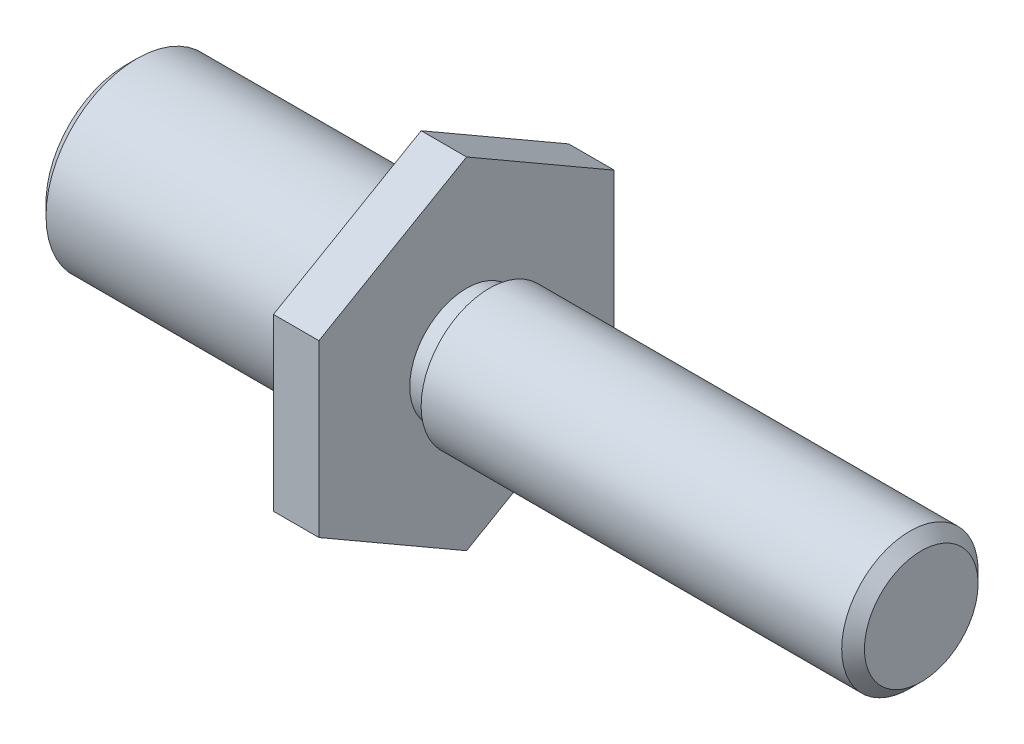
ISO-10303-21;
HEADER;
FILE_DESCRIPTION(('STEP AP214'),'2;1');
FILE_NAME('part.step','',(''),(''),'','','');
FILE_SCHEMA(('AUTOMOTIVE_DESIGN { 1 0 10303 214 1 1 1 1 }'));
ENDSEC;
DATA;
#1=APPLICATION_CONTEXT('core data for automotive mechanical design processes');
#2=APPLICATION_PROTOCOL_DEFINITION('international standard','automotive_design',2000,#1);
#3=PRODUCT_CONTEXT('',#1,'mechanical');
#4=PRODUCT('Part','Part','',(#3));
#5=PRODUCT_RELATED_PRODUCT_CATEGORY('part','',(#4));
#6=PRODUCT_DEFINITION_FORMATION('','',#4);
#7=PRODUCT_DEFINITION_CONTEXT('part definition',#1,'design');
#8=PRODUCT_DEFINITION('design','',#6,#7);
#9=PRODUCT_DEFINITION_SHAPE('','',#8);
#10=(LENGTH_UNIT() NAMED_UNIT(*) SI_UNIT(.MILLI.,.METRE.));
#11=(NAMED_UNIT(*) PLANE_ANGLE_UNIT() SI_UNIT($,.RADIAN.));
#12=(NAMED_UNIT(*) SI_UNIT($,.STERADIAN.) SOLID_ANGLE_UNIT());
#13=UNCERTAINTY_MEASURE_WITH_UNIT(LENGTH_MEASURE(1.E-05),#10,'distance_accuracy_value','');
#14=(GEOMETRIC_REPRESENTATION_CONTEXT(3) GLOBAL_UNCERTAINTY_ASSIGNED_CONTEXT((#13)) GLOBAL_UNIT_ASSIGNED_CONTEXT((#10,
#11,#12)) REPRESENTATION_CONTEXT('',''));
#15=CARTESIAN_POINT('',(0.,0.,0.));
#16=DIRECTION('',(0.,0.,1.));
#17=DIRECTION('',(1.,0.,0.));
#18=AXIS2_PLACEMENT_3D('',#15,#16,#17);
#19=CARTESIAN_POINT('',(0.,0.,0.));
#20=DIRECTION('',(1.,0.,0.));
#21=DIRECTION('',(0.,0.,-1.));
#22=AXIS2_PLACEMENT_3D('',#19,#20,#21);
#23=PLANE('',#22);
#24=CARTESIAN_POINT('',(0.,0.,0.));
#25=DIRECTION('',(1.,0.,0.));
#26=DIRECTION('',(0.,0.,-1.));
#27=AXIS2_PLACEMENT_3D('',#24,#25,#26);
#28=CIRCLE('',#27,3.5);
#29=CARTESIAN_POINT('',(0.,0.,-3.5));
#30=VERTEX_POINT('',#29);
#31=EDGE_CURVE('E158',#30,#30,#28,.F.);
#32=ORIENTED_EDGE('',*,*,#31,.T.);
#33=EDGE_LOOP('',(#32));
#34=FACE_BOUND('',#33,.T.);
#35=ADVANCED_FACE('F34',(#34),#23,.F.);
#36=CARTESIAN_POINT('',(0.,0.,0.));
#37=DIRECTION('',(-1.,0.,0.));
#38=DIRECTION('',(0.,0.,1.));
#39=AXIS2_PLACEMENT_3D('',#36,#37,#38);
#40=CYLINDRICAL_SURFACE('',#39,4.);
#41=CARTESIAN_POINT('',(0.5,0.,0.));
#42=DIRECTION('',(1.,0.,0.));
#43=DIRECTION('',(0.,0.,-1.));
#44=AXIS2_PLACEMENT_3D('',#41,#42,#43);
#45=CIRCLE('',#44,4.);
#46=CARTESIAN_POINT('',(0.5,0.,-4.));
#47=VERTEX_POINT('',#46);
#48=EDGE_CURVE('E161',#47,#47,#45,.T.);
#49=ORIENTED_EDGE('',*,*,#48,.T.);
#50=EDGE_LOOP('',(#49));
#51=FACE_BOUND('',#50,.T.);
#52=CARTESIAN_POINT('',(12.,0.,0.));
#53=DIRECTION('',(-1.,0.,0.));
#54=DIRECTION('',(0.,0.,1.));
#55=AXIS2_PLACEMENT_3D('',#52,#53,#54);
#56=CIRCLE('',#55,4.);
#57=CARTESIAN_POINT('',(12.,0.,4.));
#58=VERTEX_POINT('',#57);
#59=EDGE_CURVE('E155',#58,#58,#56,.T.);
#60=ORIENTED_EDGE('',*,*,#59,.T.);
#61=EDGE_LOOP('',(#60));
#62=FACE_BOUND('',#61,.T.);
#63=ADVANCED_FACE('F195',(#51,#62),#40,.T.);
#64=CARTESIAN_POINT('',(12.,4.,0.));
#65=DIRECTION('',(-1.,0.,0.));
#66=DIRECTION('',(0.,0.,1.));
#67=AXIS2_PLACEMENT_3D('',#64,#65,#66);
#68=PLANE('',#67);
#69=ORIENTED_EDGE('',*,*,#59,.F.);
#70=EDGE_LOOP('',(#69));
#71=FACE_BOUND('',#70,.T.);
#72=CARTESIAN_POINT('',(12.,0.,0.));
#73=DIRECTION('',(-1.,0.,0.));
#74=DIRECTION('',(0.,0.,1.));
#75=AXIS2_PLACEMENT_3D('',#72,#73,#74);
#76=CIRCLE('',#75,3.5);
#77=CARTESIAN_POINT('',(12.,0.,3.5));
#78=VERTEX_POINT('',#77);
#79=EDGE_CURVE('E152',#78,#78,#76,.T.);
#80=ORIENTED_EDGE('',*,*,#79,.T.);
#81=EDGE_LOOP('',(#80));
#82=FACE_BOUND('',#81,.T.);
#83=ADVANCED_FACE('F200',(#71,#82),#68,.F.);
#84=CARTESIAN_POINT('',(0.,0.,0.));
#85=DIRECTION('',(-1.,0.,0.));
#86=DIRECTION('',(0.,0.,1.));
#87=AXIS2_PLACEMENT_3D('',#84,#85,#86);
#88=CYLINDRICAL_SURFACE('',#87,3.5);
#89=ORIENTED_EDGE('',*,*,#79,.F.);
#90=EDGE_LOOP('',(#89));
#91=FACE_BOUND('',#90,.T.);
#92=CARTESIAN_POINT('',(13.,0.,0.));
#93=DIRECTION('',(-1.,0.,0.));
#94=DIRECTION('',(0.,0.,1.));
#95=AXIS2_PLACEMENT_3D('',#92,#93,#94);
#96=CIRCLE('',#95,3.5);
#97=CARTESIAN_POINT('',(13.,0.,3.5));
#98=VERTEX_POINT('',#97);
#99=EDGE_CURVE('E149',#98,#98,#96,.T.);
#100=ORIENTED_EDGE('',*,*,#99,.T.);
#101=EDGE_LOOP('',(#100));
#102=FACE_BOUND('',#101,.T.);
#103=ADVANCED_FACE('F214',(#91,#102),#88,.T.);
#104=CARTESIAN_POINT('',(13.,3.5,0.));
#105=DIRECTION('',(1.,0.,0.));
#106=DIRECTION('',(0.,0.,-1.));
#107=AXIS2_PLACEMENT_3D('',#104,#105,#106);
#108=PLANE('',#107);
#109=ORIENTED_EDGE('',*,*,#99,.F.);
#110=EDGE_LOOP('',(#109));
#111=FACE_BOUND('',#110,.T.);
#112=DIRECTION('',(0.,1.,0.));
#113=VECTOR('',#112,1.);
#114=CARTESIAN_POINT('',(13.,3.5,6.49519052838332));
#115=LINE('',#114,#113);
#116=CARTESIAN_POINT('',(13.,-3.74999999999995,6.49519052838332));
#117=VERTEX_POINT('',#116);
#118=CARTESIAN_POINT('',(13.,3.74999999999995,6.49519052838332));
#119=VERTEX_POINT('',#118);
#120=EDGE_CURVE('E137',#117,#119,#115,.T.);
#121=ORIENTED_EDGE('',*,*,#120,.T.);
#122=DIRECTION('',(0.,0.500000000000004,-0.866025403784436));
#123=VECTOR('',#122,1.);
#124=CARTESIAN_POINT('',(13.,6.49999999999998,1.73205080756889));
#125=LINE('',#124,#123);
#126=CARTESIAN_POINT('',(13.,7.50000000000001,0.));
#127=VERTEX_POINT('',#126);
#128=EDGE_CURVE('E122',#119,#127,#125,.T.);
#129=ORIENTED_EDGE('',*,*,#128,.T.);
#130=DIRECTION('',(0.,-0.500000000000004,-0.866025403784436));
#131=VECTOR('',#130,1.);
#132=CARTESIAN_POINT('',(13.,6.49999999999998,-1.73205080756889));
#133=LINE('',#132,#131);
#134=CARTESIAN_POINT('',(13.,3.74999999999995,-6.49519052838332));
#135=VERTEX_POINT('',#134);
#136=EDGE_CURVE('E123',#127,#135,#133,.T.);
#137=ORIENTED_EDGE('',*,*,#136,.T.);
#138=DIRECTION('',(0.,-1.,0.));
#139=VECTOR('',#138,1.);
#140=CARTESIAN_POINT('',(13.,3.5,-6.49519052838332));
#141=LINE('',#140,#139);
#142=CARTESIAN_POINT('',(13.,-3.74999999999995,-6.49519052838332));
#143=VERTEX_POINT('',#142);
#144=EDGE_CURVE('E95',#135,#143,#141,.T.);
#145=ORIENTED_EDGE('',*,*,#144,.T.);
#146=DIRECTION('',(0.,-0.500000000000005,0.866025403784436));
#147=VECTOR('',#146,1.);
#148=CARTESIAN_POINT('',(13.,-4.74999999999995,-4.76313972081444));
#149=LINE('',#148,#147);
#150=CARTESIAN_POINT('',(13.,-7.50000000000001,0.));
#151=VERTEX_POINT('',#150);
#152=EDGE_CURVE('E131',#143,#151,#149,.T.);
#153=ORIENTED_EDGE('',*,*,#152,.T.);
#154=DIRECTION('',(0.,0.500000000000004,0.866025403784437));
#155=VECTOR('',#154,1.);
#156=CARTESIAN_POINT('',(13.,-4.74999999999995,4.76313972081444));
#157=LINE('',#156,#155);
#158=EDGE_CURVE('E134',#151,#117,#157,.T.);
#159=ORIENTED_EDGE('',*,*,#158,.T.);
#160=EDGE_LOOP('',(#121,#129,#137,#145,#153,#159));
#161=FACE_BOUND('',#160,.T.);
#162=ADVANCED_FACE('F206',(#111,#161),#108,.F.);
#163=CARTESIAN_POINT('',(0.,0.,0.));
#164=DIRECTION('',(1.,0.,0.));
#165=DIRECTION('',(0.,0.,-1.));
#166=AXIS2_PLACEMENT_3D('',#163,#164,#165);
#167=CONICAL_SURFACE('',#166,3.5,0.785398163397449);
#168=ORIENTED_EDGE('',*,*,#48,.F.);
#169=EDGE_LOOP('',(#168));
#170=FACE_BOUND('',#169,.T.);
#171=ORIENTED_EDGE('',*,*,#31,.F.);
#172=EDGE_LOOP('',(#171));
#173=FACE_BOUND('',#172,.T.);
#174=ADVANCED_FACE('F204',(#170,#173),#167,.T.);
#175=CARTESIAN_POINT('',(35.,7.50000000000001,0.));
#176=DIRECTION('',(0.,-0.866025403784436,-0.500000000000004));
#177=DIRECTION('',(0.,0.500000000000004,-0.866025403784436));
#178=AXIS2_PLACEMENT_3D('',#175,#176,#177);
#179=PLANE('',#178);
#180=DIRECTION('',(-1.,0.,0.));
#181=VECTOR('',#180,1.);
#182=CARTESIAN_POINT('',(35.,3.74999999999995,6.49519052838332));
#183=LINE('',#182,#181);
#184=CARTESIAN_POINT('',(15.,3.74999999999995,6.49519052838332));
#185=VERTEX_POINT('',#184);
#186=EDGE_CURVE('E115',#185,#119,#183,.T.);
#187=ORIENTED_EDGE('',*,*,#186,.F.);
#188=DIRECTION('',(0.,-0.500000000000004,0.866025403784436));
#189=VECTOR('',#188,1.);
#190=CARTESIAN_POINT('',(15.,7.50000000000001,0.));
#191=LINE('',#190,#189);
#192=CARTESIAN_POINT('',(15.,7.50000000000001,0.));
#193=VERTEX_POINT('',#192);
#194=EDGE_CURVE('E11',#193,#185,#191,.T.);
#195=ORIENTED_EDGE('',*,*,#194,.F.);
#196=DIRECTION('',(-1.,0.,0.));
#197=VECTOR('',#196,1.);
#198=CARTESIAN_POINT('',(35.,7.50000000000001,0.));
#199=LINE('',#198,#197);
#200=EDGE_CURVE('E53',#193,#127,#199,.T.);
#201=ORIENTED_EDGE('',*,*,#200,.T.);
#202=ORIENTED_EDGE('',*,*,#128,.F.);
#203=EDGE_LOOP('',(#187,#195,#201,#202));
#204=FACE_BOUND('',#203,.T.);
#205=ADVANCED_FACE('F120',(#204),#179,.F.);
#206=CARTESIAN_POINT('',(35.,3.74999999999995,6.49519052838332));
#207=DIRECTION('',(0.,0.,-1.));
#208=DIRECTION('',(-1.,0.,0.));
#209=AXIS2_PLACEMENT_3D('',#206,#207,#208);
#210=PLANE('',#209);
#211=DIRECTION('',(-1.,0.,0.));
#212=VECTOR('',#211,1.);
#213=CARTESIAN_POINT('',(35.,-3.74999999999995,6.49519052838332));
#214=LINE('',#213,#212);
#215=CARTESIAN_POINT('',(15.,-3.74999999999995,6.49519052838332));
#216=VERTEX_POINT('',#215);
#217=EDGE_CURVE('E118',#216,#117,#214,.T.);
#218=ORIENTED_EDGE('',*,*,#217,.F.);
#219=DIRECTION('',(0.,-1.,0.));
#220=VECTOR('',#219,1.);
#221=CARTESIAN_POINT('',(15.,7.50000000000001,6.49519052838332));
#222=LINE('',#221,#220);
#223=EDGE_CURVE('E41',#185,#216,#222,.T.);
#224=ORIENTED_EDGE('',*,*,#223,.F.);
#225=ORIENTED_EDGE('',*,*,#186,.T.);
#226=ORIENTED_EDGE('',*,*,#120,.F.);
#227=EDGE_LOOP('',(#218,#224,#225,#226));
#228=FACE_BOUND('',#227,.T.);
#229=ADVANCED_FACE('F114',(#228),#210,.F.);
#230=CARTESIAN_POINT('',(35.,-3.74999999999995,6.49519052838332));
#231=DIRECTION('',(0.,0.866025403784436,-0.500000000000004));
#232=DIRECTION('',(0.,0.500000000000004,0.866025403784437));
#233=AXIS2_PLACEMENT_3D('',#230,#231,#232);
#234=PLANE('',#233);
#235=DIRECTION('',(-1.,0.,0.));
#236=VECTOR('',#235,1.);
#237=CARTESIAN_POINT('',(35.,-7.50000000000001,0.));
#238=LINE('',#237,#236);
#239=CARTESIAN_POINT('',(15.,-7.50000000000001,0.));
#240=VERTEX_POINT('',#239);
#241=EDGE_CURVE('E126',#240,#151,#238,.T.);
#242=ORIENTED_EDGE('',*,*,#241,.F.);
#243=DIRECTION('',(0.,-0.500000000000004,-0.866025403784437));
#244=VECTOR('',#243,1.);
#245=CARTESIAN_POINT('',(15.,-3.74999999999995,6.49519052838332));
#246=LINE('',#245,#244);
#247=EDGE_CURVE('E105',#216,#240,#246,.T.);
#248=ORIENTED_EDGE('',*,*,#247,.F.);
#249=ORIENTED_EDGE('',*,*,#217,.T.);
#250=ORIENTED_EDGE('',*,*,#158,.F.);
#251=EDGE_LOOP('',(#242,#248,#249,#250));
#252=FACE_BOUND('',#251,.T.);
#253=ADVANCED_FACE('F232',(#252),#234,.F.);
#254=CARTESIAN_POINT('',(35.,-7.50000000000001,0.));
#255=DIRECTION('',(0.,0.866025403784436,0.500000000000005));
#256=DIRECTION('',(0.,-0.500000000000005,0.866025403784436));
#257=AXIS2_PLACEMENT_3D('',#254,#255,#256);
#258=PLANE('',#257);
#259=DIRECTION('',(-1.,0.,0.));
#260=VECTOR('',#259,1.);
#261=CARTESIAN_POINT('',(35.,-3.74999999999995,-6.49519052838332));
#262=LINE('',#261,#260);
#263=CARTESIAN_POINT('',(15.,-3.74999999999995,-6.49519052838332));
#264=VERTEX_POINT('',#263);
#265=EDGE_CURVE('E97',#264,#143,#262,.T.);
#266=ORIENTED_EDGE('',*,*,#265,.F.);
#267=DIRECTION('',(0.,0.500000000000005,-0.866025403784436));
#268=VECTOR('',#267,1.);
#269=CARTESIAN_POINT('',(15.,-3.74999999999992,-6.49519052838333));
#270=LINE('',#269,#268);
#271=EDGE_CURVE('E103',#240,#264,#270,.T.);
#272=ORIENTED_EDGE('',*,*,#271,.F.);
#273=ORIENTED_EDGE('',*,*,#241,.T.);
#274=ORIENTED_EDGE('',*,*,#152,.F.);
#275=EDGE_LOOP('',(#266,#272,#273,#274));
#276=FACE_BOUND('',#275,.T.);
#277=ADVANCED_FACE('F227',(#276),#258,.F.);
#278=CARTESIAN_POINT('',(35.,-3.74999999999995,-6.49519052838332));
#279=DIRECTION('',(0.,0.,1.));
#280=DIRECTION('',(1.,0.,0.));
#281=AXIS2_PLACEMENT_3D('',#278,#279,#280);
#282=PLANE('',#281);
#283=DIRECTION('',(-1.,0.,0.));
#284=VECTOR('',#283,1.);
#285=CARTESIAN_POINT('',(35.,3.74999999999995,-6.49519052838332));
#286=LINE('',#285,#284);
#287=CARTESIAN_POINT('',(15.,3.74999999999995,-6.49519052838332));
#288=VERTEX_POINT('',#287);
#289=EDGE_CURVE('E48',#288,#135,#286,.T.);
#290=ORIENTED_EDGE('',*,*,#289,.F.);
#291=DIRECTION('',(0.,1.,0.));
#292=VECTOR('',#291,1.);
#293=CARTESIAN_POINT('',(15.,7.50000000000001,-6.49519052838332));
#294=LINE('',#293,#292);
#295=EDGE_CURVE('E87',#264,#288,#294,.T.);
#296=ORIENTED_EDGE('',*,*,#295,.F.);
#297=ORIENTED_EDGE('',*,*,#265,.T.);
#298=ORIENTED_EDGE('',*,*,#144,.F.);
#299=EDGE_LOOP('',(#290,#296,#297,#298));
#300=FACE_BOUND('',#299,.T.);
#301=ADVANCED_FACE('F91',(#300),#282,.F.);
#302=CARTESIAN_POINT('',(35.,3.74999999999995,-6.49519052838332));
#303=DIRECTION('',(0.,-0.866025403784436,0.500000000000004));
#304=DIRECTION('',(0.,-0.500000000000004,-0.866025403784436));
#305=AXIS2_PLACEMENT_3D('',#302,#303,#304);
#306=PLANE('',#305);
#307=ORIENTED_EDGE('',*,*,#200,.F.);
#308=DIRECTION('',(0.,0.500000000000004,0.866025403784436));
#309=VECTOR('',#308,1.);
#310=CARTESIAN_POINT('',(15.,7.50000000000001,0.));
#311=LINE('',#310,#309);
#312=EDGE_CURVE('E83',#288,#193,#311,.T.);
#313=ORIENTED_EDGE('',*,*,#312,.F.);
#314=ORIENTED_EDGE('',*,*,#289,.T.);
#315=ORIENTED_EDGE('',*,*,#136,.F.);
#316=EDGE_LOOP('',(#307,#313,#314,#315));
#317=FACE_BOUND('',#316,.T.);
#318=ADVANCED_FACE('F84',(#317),#306,.F.);
#319=CARTESIAN_POINT('',(35.,3.,0.));
#320=DIRECTION('',(-1.,0.,0.));
#321=DIRECTION('',(0.,0.,1.));
#322=AXIS2_PLACEMENT_3D('',#319,#320,#321);
#323=PLANE('',#322);
#324=CARTESIAN_POINT('',(35.,0.,0.));
#325=DIRECTION('',(-1.,0.,0.));
#326=DIRECTION('',(0.,0.,1.));
#327=AXIS2_PLACEMENT_3D('',#324,#325,#326);
#328=CIRCLE('',#327,2.5);
#329=CARTESIAN_POINT('',(35.,0.,2.5));
#330=VERTEX_POINT('',#329);
#331=EDGE_CURVE('E88',#330,#330,#328,.F.);
#332=ORIENTED_EDGE('',*,*,#331,.T.);
#333=EDGE_LOOP('',(#332));
#334=FACE_BOUND('',#333,.T.);
#335=ADVANCED_FACE('F169',(#334),#323,.F.);
#336=CARTESIAN_POINT('',(34.5,0.,0.));
#337=DIRECTION('',(-1.,0.,0.));
#338=DIRECTION('',(0.,0.,1.));
#339=AXIS2_PLACEMENT_3D('',#336,#337,#338);
#340=CONICAL_SURFACE('',#339,3.,0.785398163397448);
#341=ORIENTED_EDGE('',*,*,#331,.F.);
#342=EDGE_LOOP('',(#341));
#343=FACE_BOUND('',#342,.T.);
#344=CARTESIAN_POINT('',(34.5,0.,0.));
#345=DIRECTION('',(-1.,0.,0.));
#346=DIRECTION('',(0.,0.,1.));
#347=AXIS2_PLACEMENT_3D('',#344,#345,#346);
#348=CIRCLE('',#347,3.);
#349=CARTESIAN_POINT('',(34.5,0.,3.));
#350=VERTEX_POINT('',#349);
#351=EDGE_CURVE('E164',#350,#350,#348,.T.);
#352=ORIENTED_EDGE('',*,*,#351,.F.);
#353=EDGE_LOOP('',(#352));
#354=FACE_BOUND('',#353,.T.);
#355=ADVANCED_FACE('F171',(#343,#354),#340,.T.);
#356=CARTESIAN_POINT('',(0.,0.,0.));
#357=DIRECTION('',(-1.,0.,0.));
#358=DIRECTION('',(0.,0.,1.));
#359=AXIS2_PLACEMENT_3D('',#356,#357,#358);
#360=CYLINDRICAL_SURFACE('',#359,3.);
#361=ORIENTED_EDGE('',*,*,#351,.T.);
#362=EDGE_LOOP('',(#361));
#363=FACE_BOUND('',#362,.T.);
#364=CARTESIAN_POINT('',(16.,0.,0.));
#365=DIRECTION('',(-1.,0.,0.));
#366=DIRECTION('',(0.,0.,1.));
#367=AXIS2_PLACEMENT_3D('',#364,#365,#366);
#368=CIRCLE('',#367,3.);
#369=CARTESIAN_POINT('',(16.,0.,3.));
#370=VERTEX_POINT('',#369);
#371=EDGE_CURVE('E140',#370,#370,#368,.T.);
#372=ORIENTED_EDGE('',*,*,#371,.F.);
#373=EDGE_LOOP('',(#372));
#374=FACE_BOUND('',#373,.T.);
#375=ADVANCED_FACE('F174',(#363,#374),#360,.T.);
#376=CARTESIAN_POINT('',(16.,2.5,0.));
#377=DIRECTION('',(1.,0.,0.));
#378=DIRECTION('',(0.,0.,-1.));
#379=AXIS2_PLACEMENT_3D('',#376,#377,#378);
#380=PLANE('',#379);
#381=CARTESIAN_POINT('',(16.,0.,0.));
#382=DIRECTION('',(-1.,0.,0.));
#383=DIRECTION('',(0.,0.,1.));
#384=AXIS2_PLACEMENT_3D('',#381,#382,#383);
#385=CIRCLE('',#384,2.5);
#386=CARTESIAN_POINT('',(16.,0.,2.5));
#387=VERTEX_POINT('',#386);
#388=EDGE_CURVE('E143',#387,#387,#385,.T.);
#389=ORIENTED_EDGE('',*,*,#388,.F.);
#390=EDGE_LOOP('',(#389));
#391=FACE_BOUND('',#390,.T.);
#392=ORIENTED_EDGE('',*,*,#371,.T.);
#393=EDGE_LOOP('',(#392));
#394=FACE_BOUND('',#393,.T.);
#395=ADVANCED_FACE('F180',(#391,#394),#380,.F.);
#396=CARTESIAN_POINT('',(0.,0.,0.));
#397=DIRECTION('',(-1.,0.,0.));
#398=DIRECTION('',(0.,0.,1.));
#399=AXIS2_PLACEMENT_3D('',#396,#397,#398);
#400=CYLINDRICAL_SURFACE('',#399,2.5);
#401=CARTESIAN_POINT('',(15.,0.,0.));
#402=DIRECTION('',(-1.,0.,0.));
#403=DIRECTION('',(0.,0.,1.));
#404=AXIS2_PLACEMENT_3D('',#401,#402,#403);
#405=CIRCLE('',#404,2.5);
#406=CARTESIAN_POINT('',(15.,0.,2.5));
#407=VERTEX_POINT('',#406);
#408=EDGE_CURVE('E146',#407,#407,#405,.T.);
#409=ORIENTED_EDGE('',*,*,#408,.F.);
#410=EDGE_LOOP('',(#409));
#411=FACE_BOUND('',#410,.T.);
#412=ORIENTED_EDGE('',*,*,#388,.T.);
#413=EDGE_LOOP('',(#412));
#414=FACE_BOUND('',#413,.T.);
#415=ADVANCED_FACE('F185',(#411,#414),#400,.T.);
#416=CARTESIAN_POINT('',(15.,7.50000000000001,0.));
#417=DIRECTION('',(-1.,0.,0.));
#418=DIRECTION('',(0.,0.,1.));
#419=AXIS2_PLACEMENT_3D('',#416,#417,#418);
#420=PLANE('',#419);
#421=ORIENTED_EDGE('',*,*,#312,.T.);
#422=ORIENTED_EDGE('',*,*,#194,.T.);
#423=ORIENTED_EDGE('',*,*,#223,.T.);
#424=ORIENTED_EDGE('',*,*,#247,.T.);
#425=ORIENTED_EDGE('',*,*,#271,.T.);
#426=ORIENTED_EDGE('',*,*,#295,.T.);
#427=EDGE_LOOP('',(#421,#422,#423,#424,#425,#426));
#428=FACE_BOUND('',#427,.T.);
#429=ORIENTED_EDGE('',*,*,#408,.T.);
#430=EDGE_LOOP('',(#429));
#431=FACE_BOUND('',#430,.T.);
#432=ADVANCED_FACE('F100',(#428,#431),#420,.F.);
#433=CLOSED_SHELL('',(#35,#63,#83,#103,#162,#174,#205,#229,#253,#277,#301,#318,#335,#355,#375,
#395,#415,#432));
#434=MANIFOLD_SOLID_BREP('B2',#433);
#435=ADVANCED_BREP_SHAPE_REPRESENTATION('',(#18,#434),#14);
#436=SHAPE_DEFINITION_REPRESENTATION(#9,#435);
ENDSEC;
END-ISO-10303-21;
